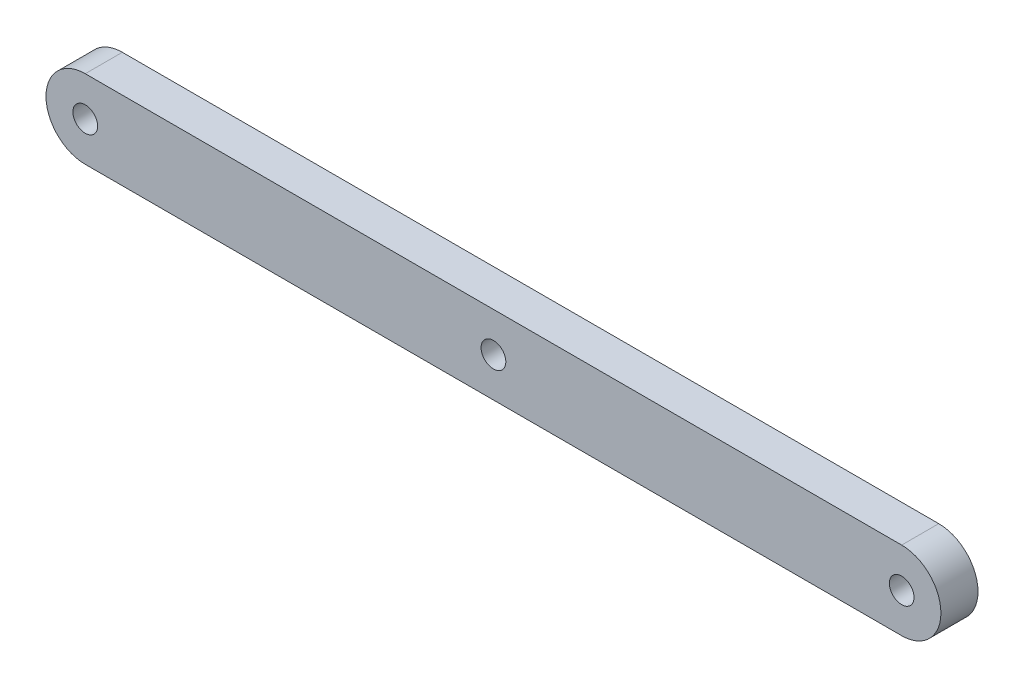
ISO-10303-21;
HEADER;
FILE_DESCRIPTION(('STEP AP214'),'2;1');
FILE_NAME('part.step','',(''),(''),'','','');
FILE_SCHEMA(('AUTOMOTIVE_DESIGN { 1 0 10303 214 1 1 1 1 }'));
ENDSEC;
DATA;
#1=APPLICATION_CONTEXT('core data for automotive mechanical design processes');
#2=APPLICATION_PROTOCOL_DEFINITION('international standard','automotive_design',2000,#1);
#3=PRODUCT_CONTEXT('',#1,'mechanical');
#4=PRODUCT('Part','Part','',(#3));
#5=PRODUCT_RELATED_PRODUCT_CATEGORY('part','',(#4));
#6=PRODUCT_DEFINITION_FORMATION('','',#4);
#7=PRODUCT_DEFINITION_CONTEXT('part definition',#1,'design');
#8=PRODUCT_DEFINITION('design','',#6,#7);
#9=PRODUCT_DEFINITION_SHAPE('','',#8);
#10=(LENGTH_UNIT() NAMED_UNIT(*) SI_UNIT(.MILLI.,.METRE.));
#11=(NAMED_UNIT(*) PLANE_ANGLE_UNIT() SI_UNIT($,.RADIAN.));
#12=(NAMED_UNIT(*) SI_UNIT($,.STERADIAN.) SOLID_ANGLE_UNIT());
#13=UNCERTAINTY_MEASURE_WITH_UNIT(LENGTH_MEASURE(1.E-05),#10,'distance_accuracy_value','');
#14=(GEOMETRIC_REPRESENTATION_CONTEXT(3) GLOBAL_UNCERTAINTY_ASSIGNED_CONTEXT((#13)) GLOBAL_UNIT_ASSIGNED_CONTEXT((#10,
#11,#12)) REPRESENTATION_CONTEXT('',''));
#15=CARTESIAN_POINT('',(0.,0.,0.));
#16=DIRECTION('',(0.,0.,1.));
#17=DIRECTION('',(1.,0.,0.));
#18=AXIS2_PLACEMENT_3D('',#15,#16,#17);
#19=CARTESIAN_POINT('',(0.,-3.175,3.000000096));
#20=DIRECTION('',(0.,1.,0.));
#21=DIRECTION('',(0.,0.,1.));
#22=AXIS2_PLACEMENT_3D('',#19,#20,#21);
#23=PLANE('',#22);
#24=DIRECTION('',(1.,0.,0.));
#25=VECTOR('',#24,1.);
#26=CARTESIAN_POINT('',(0.,-3.175,0.));
#27=LINE('',#26,#25);
#28=CARTESIAN_POINT('',(0.,-3.175,0.));
#29=VERTEX_POINT('',#28);
#30=CARTESIAN_POINT('',(66.04,-3.175,0.));
#31=VERTEX_POINT('',#30);
#32=EDGE_CURVE('E90',#29,#31,#27,.T.);
#33=ORIENTED_EDGE('',*,*,#32,.T.);
#34=DIRECTION('',(0.,0.,-1.));
#35=VECTOR('',#34,1.);
#36=CARTESIAN_POINT('',(66.04,-3.175,3.000000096));
#37=LINE('',#36,#35);
#38=CARTESIAN_POINT('',(66.04,-3.175,3.000000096));
#39=VERTEX_POINT('',#38);
#40=EDGE_CURVE('E11',#39,#31,#37,.T.);
#41=ORIENTED_EDGE('',*,*,#40,.F.);
#42=DIRECTION('',(1.,0.,0.));
#43=VECTOR('',#42,1.);
#44=CARTESIAN_POINT('',(0.,-3.175,3.000000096));
#45=LINE('',#44,#43);
#46=CARTESIAN_POINT('',(0.,-3.175,3.000000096));
#47=VERTEX_POINT('',#46);
#48=EDGE_CURVE('E97',#47,#39,#45,.T.);
#49=ORIENTED_EDGE('',*,*,#48,.F.);
#50=DIRECTION('',(0.,0.,-1.));
#51=VECTOR('',#50,1.);
#52=CARTESIAN_POINT('',(0.,-3.175,3.000000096));
#53=LINE('',#52,#51);
#54=EDGE_CURVE('E62',#47,#29,#53,.T.);
#55=ORIENTED_EDGE('',*,*,#54,.T.);
#56=EDGE_LOOP('',(#33,#41,#49,#55));
#57=FACE_BOUND('',#56,.T.);
#58=ADVANCED_FACE('F41',(#57),#23,.F.);
#59=CARTESIAN_POINT('',(0.,3.175,3.000000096));
#60=DIRECTION('',(0.,1.,0.));
#61=DIRECTION('',(0.,0.,1.));
#62=AXIS2_PLACEMENT_3D('',#59,#60,#61);
#63=PLANE('',#62);
#64=DIRECTION('',(1.,0.,0.));
#65=VECTOR('',#64,1.);
#66=CARTESIAN_POINT('',(0.,3.175,0.));
#67=LINE('',#66,#65);
#68=CARTESIAN_POINT('',(0.,3.175,0.));
#69=VERTEX_POINT('',#68);
#70=CARTESIAN_POINT('',(66.04,3.175,0.));
#71=VERTEX_POINT('',#70);
#72=EDGE_CURVE('E92',#69,#71,#67,.T.);
#73=ORIENTED_EDGE('',*,*,#72,.F.);
#74=DIRECTION('',(0.,0.,-1.));
#75=VECTOR('',#74,1.);
#76=CARTESIAN_POINT('',(0.,3.175,3.000000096));
#77=LINE('',#76,#75);
#78=CARTESIAN_POINT('',(0.,3.175,3.000000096));
#79=VERTEX_POINT('',#78);
#80=EDGE_CURVE('E106',#79,#69,#77,.T.);
#81=ORIENTED_EDGE('',*,*,#80,.F.);
#82=DIRECTION('',(1.,0.,0.));
#83=VECTOR('',#82,1.);
#84=CARTESIAN_POINT('',(0.,3.175,3.000000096));
#85=LINE('',#84,#83);
#86=CARTESIAN_POINT('',(66.04,3.175,3.000000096));
#87=VERTEX_POINT('',#86);
#88=EDGE_CURVE('E102',#79,#87,#85,.T.);
#89=ORIENTED_EDGE('',*,*,#88,.T.);
#90=DIRECTION('',(0.,0.,-1.));
#91=VECTOR('',#90,1.);
#92=CARTESIAN_POINT('',(66.04,3.175,3.000000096));
#93=LINE('',#92,#91);
#94=EDGE_CURVE('E48',#87,#71,#93,.T.);
#95=ORIENTED_EDGE('',*,*,#94,.T.);
#96=EDGE_LOOP('',(#73,#81,#89,#95));
#97=FACE_BOUND('',#96,.T.);
#98=ADVANCED_FACE('F109',(#97),#63,.T.);
#99=CARTESIAN_POINT('',(0.,0.,3.000000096));
#100=DIRECTION('',(0.,0.,-1.));
#101=DIRECTION('',(-1.,0.,0.));
#102=AXIS2_PLACEMENT_3D('',#99,#100,#101);
#103=PLANE('',#102);
#104=CARTESIAN_POINT('',(33.02,0.,3.000000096));
#105=DIRECTION('',(0.,0.,1.));
#106=DIRECTION('',(1.,0.,0.));
#107=AXIS2_PLACEMENT_3D('',#104,#105,#106);
#108=CIRCLE('',#107,1.000000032);
#109=CARTESIAN_POINT('',(34.020000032,0.,3.000000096));
#110=VERTEX_POINT('',#109);
#111=EDGE_CURVE('E133',#110,#110,#108,.T.);
#112=ORIENTED_EDGE('',*,*,#111,.F.);
#113=EDGE_LOOP('',(#112));
#114=FACE_BOUND('',#113,.T.);
#115=CARTESIAN_POINT('',(66.04,0.,3.000000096));
#116=DIRECTION('',(0.,0.,1.));
#117=DIRECTION('',(1.,0.,0.));
#118=AXIS2_PLACEMENT_3D('',#115,#116,#117);
#119=CIRCLE('',#118,1.00000003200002);
#120=CARTESIAN_POINT('',(67.040000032,0.,3.000000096));
#121=VERTEX_POINT('',#120);
#122=EDGE_CURVE('E117',#121,#121,#119,.T.);
#123=ORIENTED_EDGE('',*,*,#122,.F.);
#124=EDGE_LOOP('',(#123));
#125=FACE_BOUND('',#124,.T.);
#126=CARTESIAN_POINT('',(0.,0.,3.000000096));
#127=DIRECTION('',(0.,0.,1.));
#128=DIRECTION('',(1.,0.,0.));
#129=AXIS2_PLACEMENT_3D('',#126,#127,#128);
#130=CIRCLE('',#129,1.000000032);
#131=CARTESIAN_POINT('',(1.000000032,0.,3.000000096));
#132=VERTEX_POINT('',#131);
#133=EDGE_CURVE('E122',#132,#132,#130,.T.);
#134=ORIENTED_EDGE('',*,*,#133,.F.);
#135=EDGE_LOOP('',(#134));
#136=FACE_BOUND('',#135,.T.);
#137=ORIENTED_EDGE('',*,*,#88,.F.);
#138=CARTESIAN_POINT('',(0.,0.,3.000000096));
#139=DIRECTION('',(0.,0.,1.));
#140=DIRECTION('',(1.,0.,0.));
#141=AXIS2_PLACEMENT_3D('',#138,#139,#140);
#142=CIRCLE('',#141,3.175);
#143=EDGE_CURVE('E99',#79,#47,#142,.T.);
#144=ORIENTED_EDGE('',*,*,#143,.T.);
#145=ORIENTED_EDGE('',*,*,#48,.T.);
#146=CARTESIAN_POINT('',(66.04,0.,3.000000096));
#147=DIRECTION('',(0.,0.,1.));
#148=DIRECTION('',(1.,0.,0.));
#149=AXIS2_PLACEMENT_3D('',#146,#147,#148);
#150=CIRCLE('',#149,3.175);
#151=EDGE_CURVE('E80',#39,#87,#150,.T.);
#152=ORIENTED_EDGE('',*,*,#151,.T.);
#153=EDGE_LOOP('',(#137,#144,#145,#152));
#154=FACE_BOUND('',#153,.T.);
#155=ADVANCED_FACE('F113',(#114,#125,#136,#154),#103,.F.);
#156=CARTESIAN_POINT('',(0.,0.,0.));
#157=DIRECTION('',(0.,0.,-1.));
#158=DIRECTION('',(-1.,0.,0.));
#159=AXIS2_PLACEMENT_3D('',#156,#157,#158);
#160=PLANE('',#159);
#161=CARTESIAN_POINT('',(0.,0.,0.));
#162=DIRECTION('',(0.,0.,1.));
#163=DIRECTION('',(1.,0.,0.));
#164=AXIS2_PLACEMENT_3D('',#161,#162,#163);
#165=CIRCLE('',#164,1.000000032);
#166=CARTESIAN_POINT('',(1.000000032,0.,0.));
#167=VERTEX_POINT('',#166);
#168=EDGE_CURVE('E126',#167,#167,#165,.T.);
#169=ORIENTED_EDGE('',*,*,#168,.T.);
#170=EDGE_LOOP('',(#169));
#171=FACE_BOUND('',#170,.T.);
#172=CARTESIAN_POINT('',(66.04,0.,0.));
#173=DIRECTION('',(0.,0.,1.));
#174=DIRECTION('',(1.,0.,0.));
#175=AXIS2_PLACEMENT_3D('',#172,#173,#174);
#176=CIRCLE('',#175,1.00000003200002);
#177=CARTESIAN_POINT('',(67.040000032,0.,0.));
#178=VERTEX_POINT('',#177);
#179=EDGE_CURVE('E114',#178,#178,#176,.T.);
#180=ORIENTED_EDGE('',*,*,#179,.T.);
#181=EDGE_LOOP('',(#180));
#182=FACE_BOUND('',#181,.T.);
#183=CARTESIAN_POINT('',(33.02,0.,0.));
#184=DIRECTION('',(0.,0.,1.));
#185=DIRECTION('',(1.,0.,0.));
#186=AXIS2_PLACEMENT_3D('',#183,#184,#185);
#187=CIRCLE('',#186,1.000000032);
#188=CARTESIAN_POINT('',(34.020000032,0.,0.));
#189=VERTEX_POINT('',#188);
#190=EDGE_CURVE('E93',#189,#189,#187,.T.);
#191=ORIENTED_EDGE('',*,*,#190,.T.);
#192=EDGE_LOOP('',(#191));
#193=FACE_BOUND('',#192,.T.);
#194=ORIENTED_EDGE('',*,*,#32,.F.);
#195=CARTESIAN_POINT('',(0.,0.,0.));
#196=DIRECTION('',(0.,0.,1.));
#197=DIRECTION('',(1.,0.,0.));
#198=AXIS2_PLACEMENT_3D('',#195,#196,#197);
#199=CIRCLE('',#198,3.175);
#200=EDGE_CURVE('E95',#69,#29,#199,.T.);
#201=ORIENTED_EDGE('',*,*,#200,.F.);
#202=ORIENTED_EDGE('',*,*,#72,.T.);
#203=CARTESIAN_POINT('',(66.04,0.,0.));
#204=DIRECTION('',(0.,0.,1.));
#205=DIRECTION('',(1.,0.,0.));
#206=AXIS2_PLACEMENT_3D('',#203,#204,#205);
#207=CIRCLE('',#206,3.175);
#208=EDGE_CURVE('E54',#31,#71,#207,.T.);
#209=ORIENTED_EDGE('',*,*,#208,.F.);
#210=EDGE_LOOP('',(#194,#201,#202,#209));
#211=FACE_BOUND('',#210,.T.);
#212=ADVANCED_FACE('F88',(#171,#182,#193,#211),#160,.T.);
#213=CARTESIAN_POINT('',(0.,0.,0.));
#214=DIRECTION('',(0.,0.,1.));
#215=DIRECTION('',(1.,0.,0.));
#216=AXIS2_PLACEMENT_3D('',#213,#214,#215);
#217=CYLINDRICAL_SURFACE('',#216,3.175);
#218=ORIENTED_EDGE('',*,*,#200,.T.);
#219=ORIENTED_EDGE('',*,*,#54,.F.);
#220=ORIENTED_EDGE('',*,*,#143,.F.);
#221=ORIENTED_EDGE('',*,*,#80,.T.);
#222=EDGE_LOOP('',(#218,#219,#220,#221));
#223=FACE_BOUND('',#222,.T.);
#224=ADVANCED_FACE('F155',(#223),#217,.T.);
#225=CARTESIAN_POINT('',(0.,0.,0.));
#226=DIRECTION('',(0.,0.,1.));
#227=DIRECTION('',(1.,0.,0.));
#228=AXIS2_PLACEMENT_3D('',#225,#226,#227);
#229=CYLINDRICAL_SURFACE('',#228,1.000000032);
#230=ORIENTED_EDGE('',*,*,#133,.T.);
#231=EDGE_LOOP('',(#230));
#232=FACE_BOUND('',#231,.T.);
#233=ORIENTED_EDGE('',*,*,#168,.F.);
#234=EDGE_LOOP('',(#233));
#235=FACE_BOUND('',#234,.T.);
#236=ADVANCED_FACE('F175',(#232,#235),#229,.F.);
#237=CARTESIAN_POINT('',(66.04,0.,0.));
#238=DIRECTION('',(0.,0.,1.));
#239=DIRECTION('',(1.,0.,0.));
#240=AXIS2_PLACEMENT_3D('',#237,#238,#239);
#241=CYLINDRICAL_SURFACE('',#240,3.175);
#242=ORIENTED_EDGE('',*,*,#151,.F.);
#243=ORIENTED_EDGE('',*,*,#40,.T.);
#244=ORIENTED_EDGE('',*,*,#208,.T.);
#245=ORIENTED_EDGE('',*,*,#94,.F.);
#246=EDGE_LOOP('',(#242,#243,#244,#245));
#247=FACE_BOUND('',#246,.T.);
#248=ADVANCED_FACE('F78',(#247),#241,.T.);
#249=CARTESIAN_POINT('',(66.04,0.,0.));
#250=DIRECTION('',(0.,0.,1.));
#251=DIRECTION('',(1.,0.,0.));
#252=AXIS2_PLACEMENT_3D('',#249,#250,#251);
#253=CYLINDRICAL_SURFACE('',#252,1.00000003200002);
#254=ORIENTED_EDGE('',*,*,#122,.T.);
#255=EDGE_LOOP('',(#254));
#256=FACE_BOUND('',#255,.T.);
#257=ORIENTED_EDGE('',*,*,#179,.F.);
#258=EDGE_LOOP('',(#257));
#259=FACE_BOUND('',#258,.T.);
#260=ADVANCED_FACE('F143',(#256,#259),#253,.F.);
#261=CARTESIAN_POINT('',(33.02,0.,0.));
#262=DIRECTION('',(0.,0.,1.));
#263=DIRECTION('',(1.,0.,0.));
#264=AXIS2_PLACEMENT_3D('',#261,#262,#263);
#265=CYLINDRICAL_SURFACE('',#264,1.000000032);
#266=ORIENTED_EDGE('',*,*,#190,.F.);
#267=EDGE_LOOP('',(#266));
#268=FACE_BOUND('',#267,.T.);
#269=ORIENTED_EDGE('',*,*,#111,.T.);
#270=EDGE_LOOP('',(#269));
#271=FACE_BOUND('',#270,.T.);
#272=ADVANCED_FACE('F140',(#268,#271),#265,.F.);
#273=CLOSED_SHELL('',(#58,#98,#155,#212,#224,#236,#248,#260,#272));
#274=MANIFOLD_SOLID_BREP('B2',#273);
#275=ADVANCED_BREP_SHAPE_REPRESENTATION('',(#18,#274),#14);
#276=SHAPE_DEFINITION_REPRESENTATION(#9,#275);
ENDSEC;
END-ISO-10303-21;
